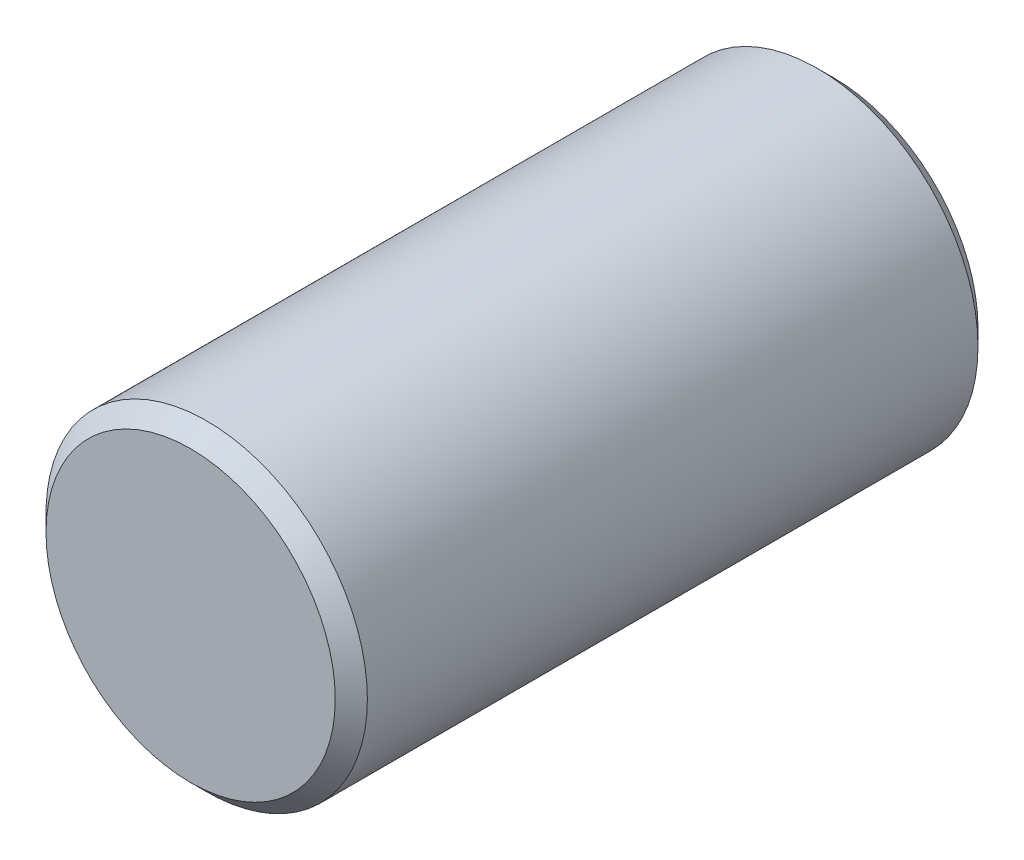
from build123d import *

# Parameters (mm, degrees)
SKIZZE1_R               = 5
LINEAR_AUSTRAGEN1_DEPTH = 20
FASE1_SIZE              = 0.5


with BuildPart() as part:
    # Skizze1 → Linear austragen1 (new body)
    with BuildSketch(Plane.XY):
        Circle(SKIZZE1_R)
    extrude(amount=LINEAR_AUSTRAGEN1_DEPTH)

    # Fase1
    fase1_edges = [part.edges().sort_by_distance(p)[0] for p in [
        (-5, 0, 0),
        (-5, 0, 20),
    ]]
    chamfer(fase1_edges, length=FASE1_SIZE)


solid = part.part
